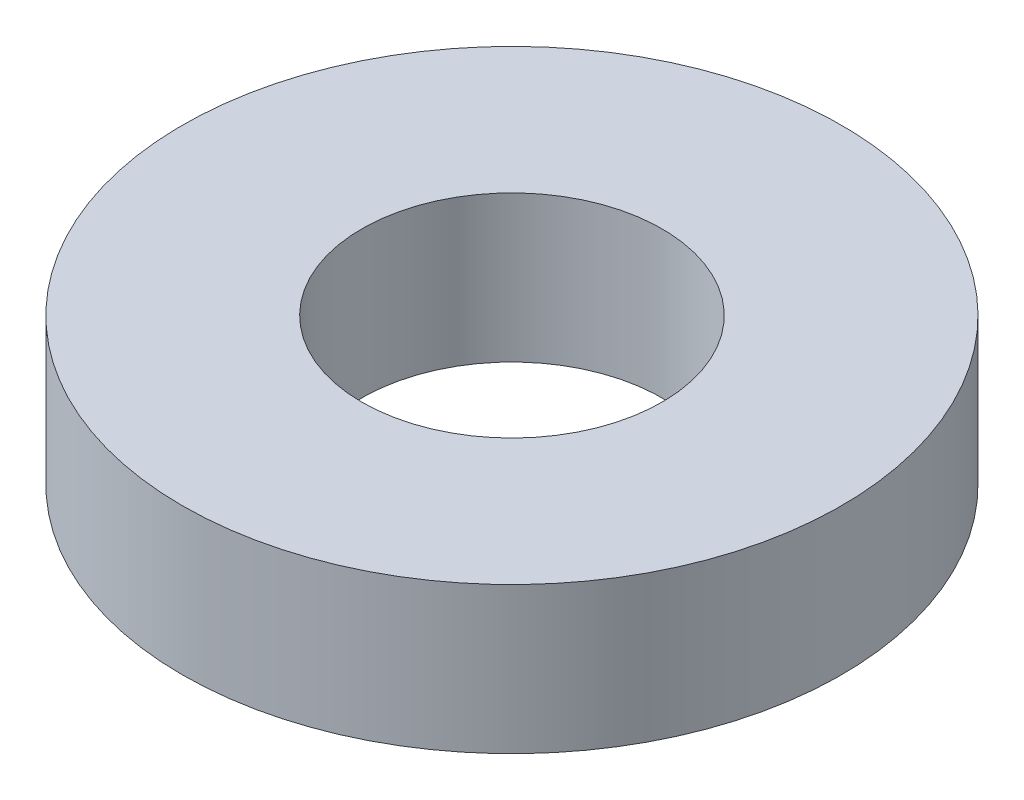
ISO-10303-21;
HEADER;
FILE_DESCRIPTION(('STEP AP214'),'2;1');
FILE_NAME('part.step','',(''),(''),'','','');
FILE_SCHEMA(('AUTOMOTIVE_DESIGN { 1 0 10303 214 1 1 1 1 }'));
ENDSEC;
DATA;
#1=APPLICATION_CONTEXT('core data for automotive mechanical design processes');
#2=APPLICATION_PROTOCOL_DEFINITION('international standard','automotive_design',2000,#1);
#3=PRODUCT_CONTEXT('',#1,'mechanical');
#4=PRODUCT('Part','Part','',(#3));
#5=PRODUCT_RELATED_PRODUCT_CATEGORY('part','',(#4));
#6=PRODUCT_DEFINITION_FORMATION('','',#4);
#7=PRODUCT_DEFINITION_CONTEXT('part definition',#1,'design');
#8=PRODUCT_DEFINITION('design','',#6,#7);
#9=PRODUCT_DEFINITION_SHAPE('','',#8);
#10=(LENGTH_UNIT() NAMED_UNIT(*) SI_UNIT(.MILLI.,.METRE.));
#11=(NAMED_UNIT(*) PLANE_ANGLE_UNIT() SI_UNIT($,.RADIAN.));
#12=(NAMED_UNIT(*) SI_UNIT($,.STERADIAN.) SOLID_ANGLE_UNIT());
#13=UNCERTAINTY_MEASURE_WITH_UNIT(LENGTH_MEASURE(1.E-05),#10,'distance_accuracy_value','');
#14=(GEOMETRIC_REPRESENTATION_CONTEXT(3) GLOBAL_UNCERTAINTY_ASSIGNED_CONTEXT((#13)) GLOBAL_UNIT_ASSIGNED_CONTEXT((#10,
#11,#12)) REPRESENTATION_CONTEXT('',''));
#15=CARTESIAN_POINT('',(0.,0.,0.));
#16=DIRECTION('',(0.,0.,1.));
#17=DIRECTION('',(1.,0.,0.));
#18=AXIS2_PLACEMENT_3D('',#15,#16,#17);
#19=CARTESIAN_POINT('',(0.,4.,0.));
#20=DIRECTION('',(0.,1.,0.));
#21=DIRECTION('',(0.,0.,1.));
#22=AXIS2_PLACEMENT_3D('',#19,#20,#21);
#23=PLANE('',#22);
#24=CARTESIAN_POINT('',(0.,4.,0.));
#25=DIRECTION('',(0.,1.,0.));
#26=DIRECTION('',(0.,0.,1.));
#27=AXIS2_PLACEMENT_3D('',#24,#25,#26);
#28=CIRCLE('',#27,9.);
#29=CARTESIAN_POINT('',(0.,4.,9.));
#30=VERTEX_POINT('',#29);
#31=EDGE_CURVE('E10',#30,#30,#28,.T.);
#32=ORIENTED_EDGE('',*,*,#31,.T.);
#33=EDGE_LOOP('',(#32));
#34=FACE_BOUND('',#33,.T.);
#35=CARTESIAN_POINT('',(0.,4.,0.));
#36=DIRECTION('',(0.,1.,0.));
#37=DIRECTION('',(0.,0.,1.));
#38=AXIS2_PLACEMENT_3D('',#35,#36,#37);
#39=CIRCLE('',#38,4.1);
#40=CARTESIAN_POINT('',(0.,4.,4.1));
#41=VERTEX_POINT('',#40);
#42=EDGE_CURVE('E45',#41,#41,#39,.T.);
#43=ORIENTED_EDGE('',*,*,#42,.F.);
#44=EDGE_LOOP('',(#43));
#45=FACE_BOUND('',#44,.T.);
#46=ADVANCED_FACE('F34',(#34,#45),#23,.T.);
#47=CARTESIAN_POINT('',(0.,0.,0.));
#48=DIRECTION('',(0.,1.,0.));
#49=DIRECTION('',(0.,0.,1.));
#50=AXIS2_PLACEMENT_3D('',#47,#48,#49);
#51=PLANE('',#50);
#52=CARTESIAN_POINT('',(0.,0.,0.));
#53=DIRECTION('',(0.,1.,0.));
#54=DIRECTION('',(0.,0.,1.));
#55=AXIS2_PLACEMENT_3D('',#52,#53,#54);
#56=CIRCLE('',#55,9.);
#57=CARTESIAN_POINT('',(0.,0.,9.));
#58=VERTEX_POINT('',#57);
#59=EDGE_CURVE('E41',#58,#58,#56,.T.);
#60=ORIENTED_EDGE('',*,*,#59,.F.);
#61=EDGE_LOOP('',(#60));
#62=FACE_BOUND('',#61,.T.);
#63=CARTESIAN_POINT('',(0.,0.,0.));
#64=DIRECTION('',(0.,1.,0.));
#65=DIRECTION('',(0.,0.,1.));
#66=AXIS2_PLACEMENT_3D('',#63,#64,#65);
#67=CIRCLE('',#66,4.1);
#68=CARTESIAN_POINT('',(0.,0.,4.1));
#69=VERTEX_POINT('',#68);
#70=EDGE_CURVE('E49',#69,#69,#67,.T.);
#71=ORIENTED_EDGE('',*,*,#70,.T.);
#72=EDGE_LOOP('',(#71));
#73=FACE_BOUND('',#72,.T.);
#74=ADVANCED_FACE('F55',(#62,#73),#51,.F.);
#75=CARTESIAN_POINT('',(0.,4.,0.));
#76=DIRECTION('',(0.,-1.,0.));
#77=DIRECTION('',(0.,0.,-1.));
#78=AXIS2_PLACEMENT_3D('',#75,#76,#77);
#79=CYLINDRICAL_SURFACE('',#78,9.);
#80=ORIENTED_EDGE('',*,*,#31,.F.);
#81=EDGE_LOOP('',(#80));
#82=FACE_BOUND('',#81,.T.);
#83=ORIENTED_EDGE('',*,*,#59,.T.);
#84=EDGE_LOOP('',(#83));
#85=FACE_BOUND('',#84,.T.);
#86=ADVANCED_FACE('F36',(#82,#85),#79,.T.);
#87=CARTESIAN_POINT('',(0.,4.,0.));
#88=DIRECTION('',(0.,-1.,0.));
#89=DIRECTION('',(0.,0.,-1.));
#90=AXIS2_PLACEMENT_3D('',#87,#88,#89);
#91=CYLINDRICAL_SURFACE('',#90,4.1);
#92=ORIENTED_EDGE('',*,*,#42,.T.);
#93=EDGE_LOOP('',(#92));
#94=FACE_BOUND('',#93,.T.);
#95=ORIENTED_EDGE('',*,*,#70,.F.);
#96=EDGE_LOOP('',(#95));
#97=FACE_BOUND('',#96,.T.);
#98=ADVANCED_FACE('F57',(#94,#97),#91,.F.);
#99=CLOSED_SHELL('',(#46,#74,#86,#98));
#100=MANIFOLD_SOLID_BREP('B2',#99);
#101=ADVANCED_BREP_SHAPE_REPRESENTATION('',(#18,#100),#14);
#102=SHAPE_DEFINITION_REPRESENTATION(#9,#101);
ENDSEC;
END-ISO-10303-21;
